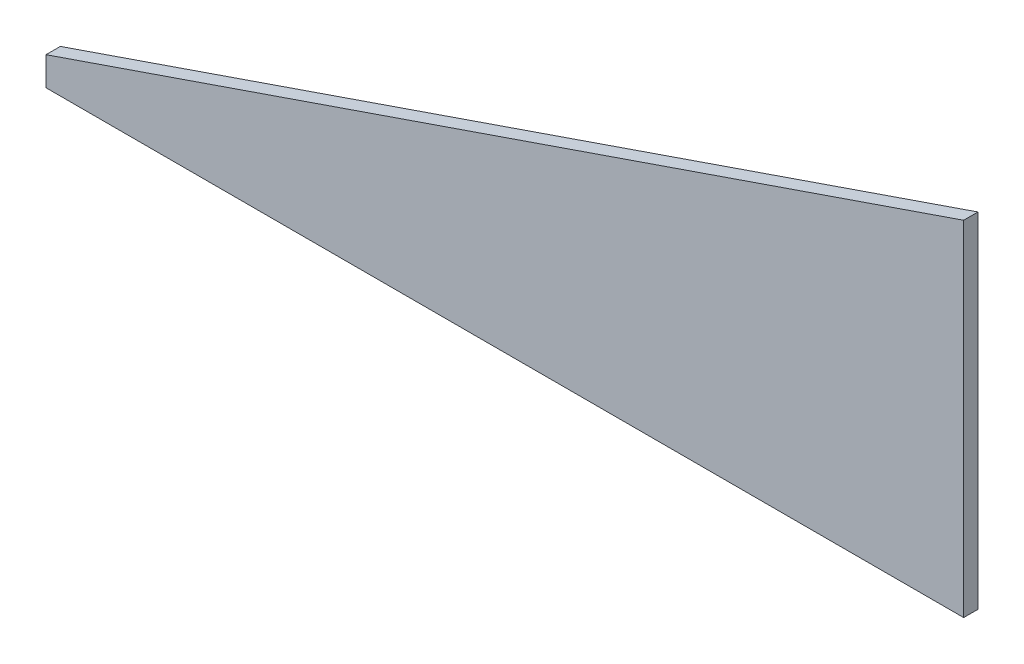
ISO-10303-21;
HEADER;
FILE_DESCRIPTION(('STEP AP214'),'2;1');
FILE_NAME('part.step','',(''),(''),'','','');
FILE_SCHEMA(('AUTOMOTIVE_DESIGN { 1 0 10303 214 1 1 1 1 }'));
ENDSEC;
DATA;
#1=APPLICATION_CONTEXT('core data for automotive mechanical design processes');
#2=APPLICATION_PROTOCOL_DEFINITION('international standard','automotive_design',2000,#1);
#3=PRODUCT_CONTEXT('',#1,'mechanical');
#4=PRODUCT('Part','Part','',(#3));
#5=PRODUCT_RELATED_PRODUCT_CATEGORY('part','',(#4));
#6=PRODUCT_DEFINITION_FORMATION('','',#4);
#7=PRODUCT_DEFINITION_CONTEXT('part definition',#1,'design');
#8=PRODUCT_DEFINITION('design','',#6,#7);
#9=PRODUCT_DEFINITION_SHAPE('','',#8);
#10=(LENGTH_UNIT() NAMED_UNIT(*) SI_UNIT(.MILLI.,.METRE.));
#11=(NAMED_UNIT(*) PLANE_ANGLE_UNIT() SI_UNIT($,.RADIAN.));
#12=(NAMED_UNIT(*) SI_UNIT($,.STERADIAN.) SOLID_ANGLE_UNIT());
#13=UNCERTAINTY_MEASURE_WITH_UNIT(LENGTH_MEASURE(1.E-05),#10,'distance_accuracy_value','');
#14=(GEOMETRIC_REPRESENTATION_CONTEXT(3) GLOBAL_UNCERTAINTY_ASSIGNED_CONTEXT((#13)) GLOBAL_UNIT_ASSIGNED_CONTEXT((#10,
#11,#12)) REPRESENTATION_CONTEXT('',''));
#15=CARTESIAN_POINT('',(0.,0.,0.));
#16=DIRECTION('',(0.,0.,1.));
#17=DIRECTION('',(1.,0.,0.));
#18=AXIS2_PLACEMENT_3D('',#15,#16,#17);
#19=CARTESIAN_POINT('',(4.44089209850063E-13,0.,2.5));
#20=DIRECTION('',(1.,0.,0.));
#21=DIRECTION('',(0.,0.,-1.));
#22=AXIS2_PLACEMENT_3D('',#19,#20,#21);
#23=PLANE('',#22);
#24=DIRECTION('',(0.,-1.,0.));
#25=VECTOR('',#24,1.);
#26=CARTESIAN_POINT('',(4.44089209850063E-13,0.,0.));
#27=LINE('',#26,#25);
#28=CARTESIAN_POINT('',(4.44089209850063E-13,5.,0.));
#29=VERTEX_POINT('',#28);
#30=CARTESIAN_POINT('',(4.44089209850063E-13,0.,0.));
#31=VERTEX_POINT('',#30);
#32=EDGE_CURVE('E85',#29,#31,#27,.T.);
#33=ORIENTED_EDGE('',*,*,#32,.T.);
#34=DIRECTION('',(0.,0.,-1.));
#35=VECTOR('',#34,1.);
#36=CARTESIAN_POINT('',(4.44089209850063E-13,0.,2.5));
#37=LINE('',#36,#35);
#38=CARTESIAN_POINT('',(4.44089209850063E-13,0.,2.5));
#39=VERTEX_POINT('',#38);
#40=EDGE_CURVE('E11',#39,#31,#37,.T.);
#41=ORIENTED_EDGE('',*,*,#40,.F.);
#42=DIRECTION('',(0.,-1.,0.));
#43=VECTOR('',#42,1.);
#44=CARTESIAN_POINT('',(4.44089209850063E-13,0.,2.5));
#45=LINE('',#44,#43);
#46=CARTESIAN_POINT('',(4.44089209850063E-13,5.,2.5));
#47=VERTEX_POINT('',#46);
#48=EDGE_CURVE('E109',#47,#39,#45,.T.);
#49=ORIENTED_EDGE('',*,*,#48,.F.);
#50=DIRECTION('',(0.,0.,-1.));
#51=VECTOR('',#50,1.);
#52=CARTESIAN_POINT('',(4.44089209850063E-13,5.,2.5));
#53=LINE('',#52,#51);
#54=EDGE_CURVE('E98',#47,#29,#53,.T.);
#55=ORIENTED_EDGE('',*,*,#54,.T.);
#56=EDGE_LOOP('',(#33,#41,#49,#55));
#57=FACE_BOUND('',#56,.T.);
#58=ADVANCED_FACE('F40',(#57),#23,.F.);
#59=CARTESIAN_POINT('',(4.44089209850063E-13,0.,2.5));
#60=DIRECTION('',(0.,1.,0.));
#61=DIRECTION('',(0.,0.,1.));
#62=AXIS2_PLACEMENT_3D('',#59,#60,#61);
#63=PLANE('',#62);
#64=DIRECTION('',(1.,0.,0.));
#65=VECTOR('',#64,1.);
#66=CARTESIAN_POINT('',(4.44089209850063E-13,0.,0.));
#67=LINE('',#66,#65);
#68=CARTESIAN_POINT('',(160.,3.33066907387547E-13,0.));
#69=VERTEX_POINT('',#68);
#70=EDGE_CURVE('E81',#31,#69,#67,.T.);
#71=ORIENTED_EDGE('',*,*,#70,.T.);
#72=DIRECTION('',(0.,0.,-1.));
#73=VECTOR('',#72,1.);
#74=CARTESIAN_POINT('',(160.,3.33066907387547E-13,2.5));
#75=LINE('',#74,#73);
#76=CARTESIAN_POINT('',(160.,3.33066907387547E-13,2.5));
#77=VERTEX_POINT('',#76);
#78=EDGE_CURVE('E48',#77,#69,#75,.T.);
#79=ORIENTED_EDGE('',*,*,#78,.F.);
#80=DIRECTION('',(1.,0.,0.));
#81=VECTOR('',#80,1.);
#82=CARTESIAN_POINT('',(4.44089209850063E-13,0.,2.5));
#83=LINE('',#82,#81);
#84=EDGE_CURVE('E94',#39,#77,#83,.T.);
#85=ORIENTED_EDGE('',*,*,#84,.F.);
#86=ORIENTED_EDGE('',*,*,#40,.T.);
#87=EDGE_LOOP('',(#71,#79,#85,#86));
#88=FACE_BOUND('',#87,.T.);
#89=ADVANCED_FACE('F93',(#88),#63,.F.);
#90=CARTESIAN_POINT('',(160.,3.33066907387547E-13,2.5));
#91=DIRECTION('',(-1.,0.,0.));
#92=DIRECTION('',(0.,0.,1.));
#93=AXIS2_PLACEMENT_3D('',#90,#91,#92);
#94=PLANE('',#93);
#95=DIRECTION('',(0.,1.,0.));
#96=VECTOR('',#95,1.);
#97=CARTESIAN_POINT('',(160.,3.33066907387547E-13,0.));
#98=LINE('',#97,#96);
#99=CARTESIAN_POINT('',(160.,60.0000000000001,0.));
#100=VERTEX_POINT('',#99);
#101=EDGE_CURVE('E86',#69,#100,#98,.T.);
#102=ORIENTED_EDGE('',*,*,#101,.T.);
#103=DIRECTION('',(0.,0.,-1.));
#104=VECTOR('',#103,1.);
#105=CARTESIAN_POINT('',(160.,60.0000000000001,2.5));
#106=LINE('',#105,#104);
#107=CARTESIAN_POINT('',(160.,60.0000000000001,2.5));
#108=VERTEX_POINT('',#107);
#109=EDGE_CURVE('E119',#108,#100,#106,.T.);
#110=ORIENTED_EDGE('',*,*,#109,.F.);
#111=DIRECTION('',(0.,1.,0.));
#112=VECTOR('',#111,1.);
#113=CARTESIAN_POINT('',(160.,3.33066907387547E-13,2.5));
#114=LINE('',#113,#112);
#115=EDGE_CURVE('E60',#77,#108,#114,.T.);
#116=ORIENTED_EDGE('',*,*,#115,.F.);
#117=ORIENTED_EDGE('',*,*,#78,.T.);
#118=EDGE_LOOP('',(#102,#110,#116,#117));
#119=FACE_BOUND('',#118,.T.);
#120=ADVANCED_FACE('F123',(#119),#94,.F.);
#121=CARTESIAN_POINT('',(4.44089209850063E-13,5.,2.5));
#122=DIRECTION('',(0.325079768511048,-0.945686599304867,0.));
#123=DIRECTION('',(0.945686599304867,0.325079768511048,0.));
#124=AXIS2_PLACEMENT_3D('',#121,#122,#123);
#125=PLANE('',#124);
#126=DIRECTION('',(-0.945686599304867,-0.325079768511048,0.));
#127=VECTOR('',#126,1.);
#128=CARTESIAN_POINT('',(4.44089209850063E-13,5.,0.));
#129=LINE('',#128,#127);
#130=EDGE_CURVE('E106',#100,#29,#129,.T.);
#131=ORIENTED_EDGE('',*,*,#130,.T.);
#132=ORIENTED_EDGE('',*,*,#54,.F.);
#133=DIRECTION('',(-0.945686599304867,-0.325079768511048,0.));
#134=VECTOR('',#133,1.);
#135=CARTESIAN_POINT('',(4.44089209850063E-13,5.,2.5));
#136=LINE('',#135,#134);
#137=EDGE_CURVE('E55',#108,#47,#136,.T.);
#138=ORIENTED_EDGE('',*,*,#137,.F.);
#139=ORIENTED_EDGE('',*,*,#109,.T.);
#140=EDGE_LOOP('',(#131,#132,#138,#139));
#141=FACE_BOUND('',#140,.T.);
#142=ADVANCED_FACE('F125',(#141),#125,.F.);
#143=CARTESIAN_POINT('',(4.44089209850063E-13,0.,2.5));
#144=DIRECTION('',(0.,0.,-1.));
#145=DIRECTION('',(-1.,0.,0.));
#146=AXIS2_PLACEMENT_3D('',#143,#144,#145);
#147=PLANE('',#146);
#148=ORIENTED_EDGE('',*,*,#48,.T.);
#149=ORIENTED_EDGE('',*,*,#84,.T.);
#150=ORIENTED_EDGE('',*,*,#115,.T.);
#151=ORIENTED_EDGE('',*,*,#137,.T.);
#152=EDGE_LOOP('',(#148,#149,#150,#151));
#153=FACE_BOUND('',#152,.T.);
#154=ADVANCED_FACE('F126',(#153),#147,.F.);
#155=CARTESIAN_POINT('',(4.44089209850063E-13,0.,0.));
#156=DIRECTION('',(0.,0.,-1.));
#157=DIRECTION('',(-1.,0.,0.));
#158=AXIS2_PLACEMENT_3D('',#155,#156,#157);
#159=PLANE('',#158);
#160=ORIENTED_EDGE('',*,*,#32,.F.);
#161=ORIENTED_EDGE('',*,*,#130,.F.);
#162=ORIENTED_EDGE('',*,*,#101,.F.);
#163=ORIENTED_EDGE('',*,*,#70,.F.);
#164=EDGE_LOOP('',(#160,#161,#162,#163));
#165=FACE_BOUND('',#164,.T.);
#166=ADVANCED_FACE('F82',(#165),#159,.T.);
#167=CLOSED_SHELL('',(#58,#89,#120,#142,#154,#166));
#168=MANIFOLD_SOLID_BREP('B2',#167);
#169=ADVANCED_BREP_SHAPE_REPRESENTATION('',(#18,#168),#14);
#170=SHAPE_DEFINITION_REPRESENTATION(#9,#169);
ENDSEC;
END-ISO-10303-21;
